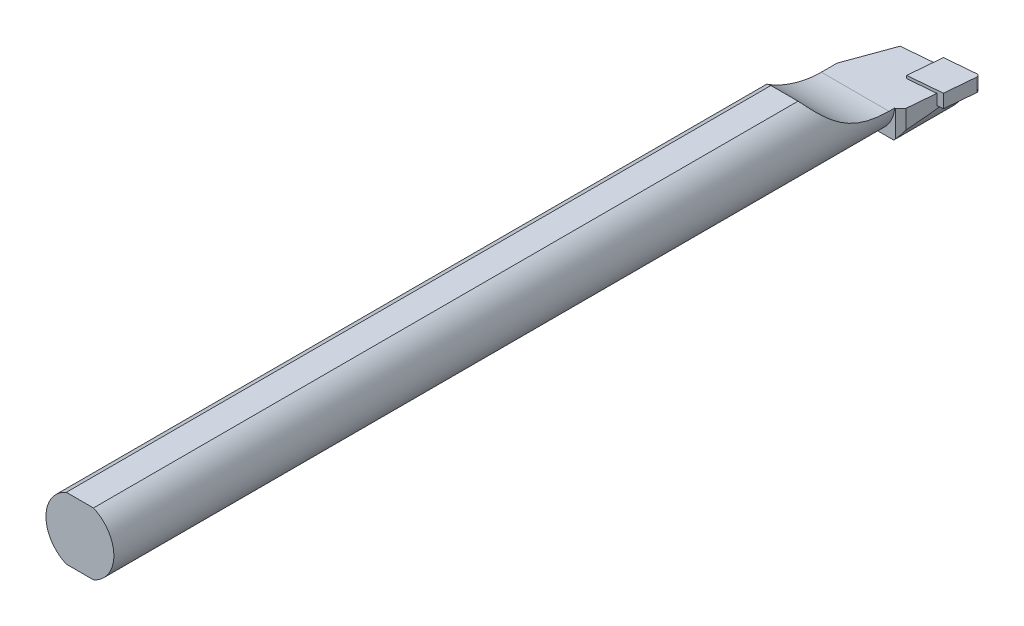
from build123d import *

# Parameters (mm, degrees)
ESQUISSE4_W                  = 6
ESQUISSE4_H                  = 149
ENL_V_MAT_EXTRU_5_DEPTH      = 50
ENL_V_MAT_EXTRU_5_DEPTH_BACK = 50
ENL_V_MAT_EXTRU_6_DEPTH      = 50
ENL_V_MAT_EXTRU_6_DEPTH_BACK = 50
BOSS_EXTRU_1_DEPTH           = 7.5
ENL_V_MAT_EXTRU_9_DEPTH      = 50
BOSS_EXTRU_4_DEPTH           = 2.38
ESQUISSE10_W                 = 500
ESQUISSE10_H                 = 36.5
ESQUISSE10_H_2               = 41.5
ENL_V_MAT_EXTRU_10_DEPTH     = 40


with BuildPart() as part:
    # Esquisse4 → Base-R_volution (revolve)
    with BuildSketch(Plane(origin=(0, 0, 0), x_dir=(1, 0, 0), z_dir=(0, 1, 0)), mode=Mode.PRIVATE) as base_r_volution_sk:
        with Locations((-12, -75.5)):
            Rectangle(ESQUISSE4_W, ESQUISSE4_H)
    revolve(base_r_volution_sk.sketch.rotate(Axis((-9, 0, 150), (0, 0, -1)), 180), axis=Axis((-9, 0, 150), (0, 0, -1)))

    # Esquisse5 → Enl_v. mat.-Extru.5 (cut, two sides: drawn at the far end of the back side and taken through both)
    with BuildSketch(Plane(origin=(0, 0, 0), x_dir=(1, 0, 0), z_dir=(0, 1, 0)).offset(-ENL_V_MAT_EXTRU_5_DEPTH_BACK)):
        Polygon((-12, -2.0536838), (31.071939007, 1.714622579), (31.071939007, 3.714622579), (-42.633713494, 3.714622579), (-42.633713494, -34.017048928), (-23.633713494, -34.017048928), align=None)
    extrude(amount=ENL_V_MAT_EXTRU_5_DEPTH + ENL_V_MAT_EXTRU_5_DEPTH_BACK, mode=Mode.SUBTRACT)

    # Esquisse6 → Enl_v. mat.-Extru.6 (cut, two sides: drawn at the far end of the back side and taken through both)
    with BuildSketch(Plane(origin=(0, 0, 0), x_dir=(0, 0, -1), z_dir=(1, 0, 0)).offset(-ENL_V_MAT_EXTRU_6_DEPTH_BACK)):
        with BuildLine():
            Line((1, 15.5), (1, -0.5))
            Line((1, -0.5), (-13, -0.5))
            ThreePointArc((-13, -0.5), (-24.313708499, 4.186291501), (-29, 15.5))
            Line((-29, 15.5), (1, 15.5))
        make_face()
    extrude(amount=ENL_V_MAT_EXTRU_6_DEPTH + ENL_V_MAT_EXTRU_6_DEPTH_BACK, mode=Mode.SUBTRACT)

    # Esquisse7 → Boss.-Extru.1 (add)
    with BuildSketch(Plane(origin=(0, -0.5, 0), x_dir=(-1, 0, 0), z_dir=(0, 1, 0))):
        Polygon((1.100062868, 1.100062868), (11, 1.966195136), (11, 12), (2.909610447, 12), (1.971620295, 11.062009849), align=None)
    extrude(amount=-BOSS_EXTRU_1_DEPTH)

    # Esquisse8 → Enl_v. mat.-Extru.9 (cut)
    with BuildSketch(Plane.XY):
        with BuildLine():
            Line((-17, 0), (-41.186773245, 0))
            ThreePointArc((-41.186773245, 0), (-9, -32.186773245), (23.186773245, 0))
            Line((23.186773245, 0), (-1, 0))
            ThreePointArc((-1, 0), (-9, -8), (-17, 0))
        make_face()
    extrude(amount=ENL_V_MAT_EXTRU_9_DEPTH, mode=Mode.SUBTRACT)

    # EsqPlaquette → Boss.-Extru.4 (add)
    with BuildSketch(Plane(origin=(0, 0, 0), x_dir=(1, 0, 0), z_dir=(0, 1, 0))):
        with BuildLine():
            Line((-0.472903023, -5.927136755), (-6.450071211, -6.450071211))
            Line((-6.450071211, -6.450071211), (-5.927136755, -0.472903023))
            Line((-5.927136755, -0.472903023), (-0.543577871, -0.001902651))
            ThreePointArc((-0.543577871, -0.001902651), (-0.146446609, -0.146446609), (-0.001902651, -0.543577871))
            Line((-0.001902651, -0.543577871), (-0.472903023, -5.927136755))
        make_face()
    extrude(amount=-BOSS_EXTRU_4_DEPTH)

    # Esquisse10 → Enl_v. mat.-Extru.10 (cut)
    with BuildSketch(Plane(origin=(0, 0, 0), x_dir=(0, 0, -1), z_dir=(1, 0, 0))):
        with Locations((-244, 23.75)):
            Rectangle(ESQUISSE10_W, ESQUISSE10_H)
        with Locations((-244, -26.25)):
            Rectangle(ESQUISSE10_W, ESQUISSE10_H_2)
    extrude(amount=-ENL_V_MAT_EXTRU_10_DEPTH, mode=Mode.SUBTRACT)


solid = part.part
